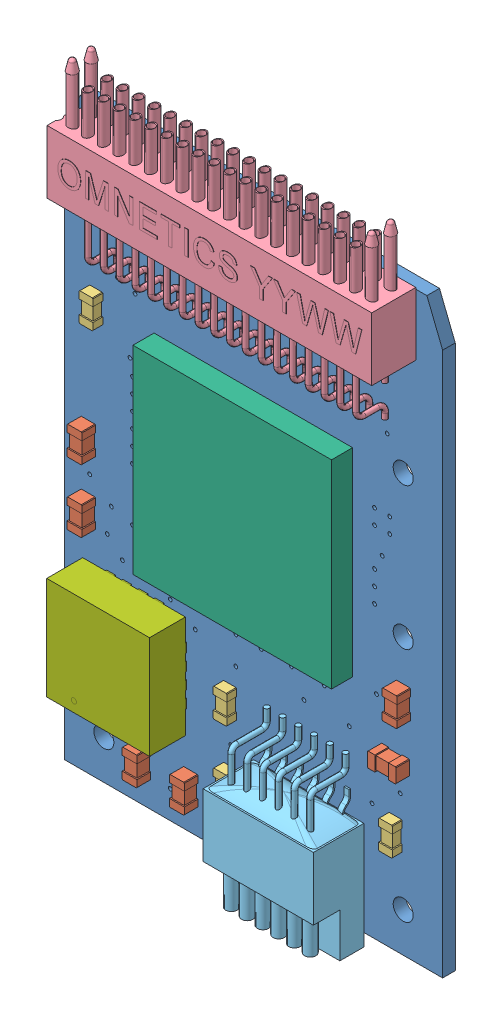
SolidWorks assembly RHD2132_accel_headstage.SLDASM, configuration Default (file format 15000). Lengths in mm.
Overall size (15.24 26.43 2.55).
15 component instances, 7 part files, 30 mates.
Components (placement in the parent):
- RHD2216_RHD2132_accel_headstage_PCB-1: RHD2216_RHD2132_accel_headstage_PCB.SLDPRT [Default] at origin size (15.24 23.49 0.51)
- 0402c_2320560-1: 0402c_2320560.sldprt [Default] at (13.6525 8.89 0.508) x (0 -1 0) z (0 0 1) size (1.15 0.6 0.55)
- 0402c_2320560-2: 0402c_2320560.sldprt [Default] at (3.175 1.5875 0.508) x (0 -1 0) z (0 0 1) size (1.15 0.6 0.55)
- 0402c_2320560-3: 0402c_2320560.sldprt [Default] at (13.335 6.6675 0.508) size (1.15 0.6 0.55)
- 0402c_2320560-4: 0402c_2320560.sldprt [Default] at (0.9525 11.7475 0.508) x (0 1 0) z (0 0 1) size (1.15 0.6 0.55)
- 0402c_2320560-5: 0402c_2320560.sldprt [Default] at (0.9525 9.2075 0.508) x (0 1 0) z (0 0 1) size (1.15 0.6 0.55)
- 0402c_2320560-6: 0402c_2320560.sldprt [Default] at (5.08 1.5875 0.508) x (0 1 0) z (0 0 1) size (1.15 0.6 0.55)
- 0402r_1430758-1: 0402r_1430758.sldprt [Default] at (1.27 16.4975 0.508) x (0 -1 0) z (0 0 1) size (1.15 0.55 0.4)
- 0402r_1430758-2: 0402r_1430758.sldprt [Default] at (6.6675 5.3975 0.508) x (0 1 0) z (0 0 1) size (1.15 0.55 0.4)
- 0402r_1430758-3: 0402r_1430758.sldprt [Default] at (6.6675 2.54 0.508) x (0 1 0) z (0 0 1) size (1.15 0.55 0.4)
- 0402r_1430758-4: 0402r_1430758.sldprt [Default] at (13.335 4.1275 0.508) x (0 1 0) z (0 0 1) size (1.15 0.55 0.4)
- A79025-001-1: A79025-001.SLDPRT [Default] at (6.35 22.2885 2.286) size (13.15 7.44 2.12)
- A79623-001-1: A79623-001.SLDPRT [Default] at (9.8425 3.81 0.508) x (1 0 0) z (0 -1 0) size (4.45 2.05 6.53)
- QFN_8x8mm-1: QFN_8x8mm.SLDPRT [Default] at (3.6119 8.6919 0.508) x (1 0 0) z (0 -1 0) size (8 0.85 8)
- ADXL335-1: ADXL335.SLDPRT [Default] at (2.8575 5.3975 0.508) x (0 1 0) z (0 0 1) size (4.14 4.14 1.5)
Mates (geometry in assembly coordinates):
- Coincident1: coincident anti-aligned: plane of rhd2132_headstage_accel-1 through (0 0 0.508) normal (0 0 1); plane of A79025-001-1 through (14.1605 21.0185 0.508) normal (0 0 -1)
- Parallel1: parallel aligned: plane of rhd2132_headstage_accel-1 through (0.635 23.495 0.508) normal (0 1 0); plane of A79025-001-1 through (14.1605 23.5585 2.286) normal (0 1 0)
- Distance1: distance = 0.0635 mm: line of A79025-001-1 through (1.0795 23.5585 0.508) axis (1 0 0); line of rhd2132_headstage_accel-1 through (14.605 23.495 0.508) axis (-1 0 0)
- Distance2: distance = 1.0795 mm: line of rhd2132_headstage_accel-1 through (0 21.9075 0.508) axis (0 -1 0); line of A79025-001-1 through (1.0795 21.0446 0.508) axis (0 1 0)
- Coincident4: coincident anti-aligned: plane of rhd2132_headstage_accel-1 through (0 0 0.508) normal (0 0 1); plane of QFN_8x8mm-1 through (3.6119 8.6919 0.508) normal (0 0 -1)
- Parallel2: parallel aligned: plane of rhd2132_headstage_accel-1 through (15.24 21.9075 0.508) normal (1 0 0); plane of QFN_8x8mm-1 through (11.6119 8.6919 1.358) normal (1 0 0)
- Coincident6: coincident anti-aligned: plane of rhd2132_headstage_accel-1 through (0 0 0.508) normal (0 0 1); plane of ADXL335-1 through (1.5875 4.1275 0.508) normal (0 0 -1)
- Parallel3: parallel aligned: plane of rhd2132_headstage_accel-1 through (0 0 0.508) normal (-1 0 0); plane of ADXL335-1 through (0.7875 7.4675 0.559) normal (-1 0 0)
- Coincident7: coincident anti-aligned: plane of rhd2132_headstage_accel-1 through (0 0 0.508) normal (0 0 1); plane of A79623-001-1 through (9.8425 3.81 0.508) normal (0 0 -1)
- Parallel4: parallel aligned: plane of rhd2132_headstage_accel-1 through (15.24 0 0.508) normal (0 -1 0); plane of A79623-001-1 through (12.065 -0.508 0.508) normal (0 -1 0)
- Coincident8: coincident anti-aligned: plane of rhd2132_headstage_accel-1 through (0 0 0.508) normal (0 0 1); plane of 0402r_1430758-1 through (2.095 16.4975 0.508) normal (0 0 -1)
- Parallel5: parallel aligned: plane of rhd2132_headstage_accel-1 through (15.24 0 0.508) normal (0 -1 0); plane of 0402r_1430758-1 through (1.02 15.9225 0.908) normal (0 -1 0)
- Coincident9: coincident anti-aligned: plane of rhd2132_headstage_accel-1 through (0 0 0.508) normal (0 0 1); plane of 0402c_2320560-4 through (0.1025 11.7475 0.508) normal (0 0 -1)
- Parallel6: parallel aligned: plane of rhd2132_headstage_accel-1 through (15.24 0 0.508) normal (0 -1 0); plane of 0402c_2320560-4 through (0.6775 11.1725 1.058) normal (0 -1 0)
- Coincident10: coincident anti-aligned: plane of rhd2132_headstage_accel-1 through (0 0 0.508) normal (0 0 1); plane of 0402c_2320560-5 through (0.1025 9.2075 0.508) normal (0 0 -1)
- Parallel7: parallel aligned: plane of rhd2132_headstage_accel-1 through (15.24 0 0.508) normal (0 -1 0); plane of 0402c_2320560-5 through (0.6775 8.6325 1.058) normal (0 -1 0)
- Coincident11: coincident anti-aligned: plane of rhd2132_headstage_accel-1 through (0 0 0.508) normal (0 0 1); plane of 0402c_2320560-2 through (4.025 1.5875 0.508) normal (0 0 -1)
- Parallel8: parallel aligned: plane of rhd2132_headstage_accel-1 through (15.24 0 0.508) normal (0 -1 0); plane of 0402c_2320560-2 through (2.9 1.0125 1.058) normal (0 -1 0)
- Coincident12: coincident anti-aligned: plane of rhd2132_headstage_accel-1 through (0 0 0.508) normal (0 0 1); plane of 0402c_2320560-6 through (4.23 1.5875 0.508) normal (0 0 -1)
- Parallel9: parallel aligned: plane of rhd2132_headstage_accel-1 through (15.24 0 0.508) normal (0 -1 0); plane of 0402c_2320560-6 through (4.805 1.0125 1.058) normal (0 -1 0)
- Coincident13: coincident anti-aligned: plane of rhd2132_headstage_accel-1 through (0 0 0.508) normal (0 0 1); plane of 0402r_1430758-3 through (5.8425 2.54 0.508) normal (0 0 -1)
- Parallel10: parallel aligned: plane of rhd2132_headstage_accel-1 through (15.24 0 0.508) normal (0 -1 0); plane of 0402r_1430758-3 through (6.4175 1.965 0.908) normal (0 -1 0)
- Coincident14: coincident anti-aligned: plane of rhd2132_headstage_accel-1 through (0 0 0.508) normal (0 0 1); plane of 0402r_1430758-2 through (5.8425 5.3975 0.508) normal (0 0 -1)
- Parallel11: parallel aligned: plane of rhd2132_headstage_accel-1 through (15.24 0 0.508) normal (0 -1 0); plane of 0402r_1430758-2 through (6.4175 4.8225 0.908) normal (0 -1 0)
- Coincident15: coincident anti-aligned: plane of rhd2132_headstage_accel-1 through (0 0 0.508) normal (0 0 1); plane of 0402r_1430758-4 through (12.51 4.1275 0.508) normal (0 0 -1)
- Parallel12: parallel aligned: plane of rhd2132_headstage_accel-1 through (15.24 0 0.508) normal (0 -1 0); plane of 0402r_1430758-4 through (13.085 3.5525 0.908) normal (0 -1 0)
- Coincident16: coincident anti-aligned: plane of rhd2132_headstage_accel-1 through (0 0 0.508) normal (0 0 1); plane of 0402c_2320560-3 through (13.335 7.5175 0.508) normal (0 0 -1)
- Parallel13: parallel aligned: plane of rhd2132_headstage_accel-1 through (15.24 21.9075 0.508) normal (1 0 0); plane of 0402c_2320560-3 through (13.91 6.3925 1.058) normal (1 0 0)
- Coincident17: coincident anti-aligned: plane of rhd2132_headstage_accel-1 through (0 0 0.508) normal (0 0 1); plane of 0402c_2320560-1 through (14.5025 8.89 0.508) normal (0 0 -1)
- Parallel14: parallel aligned: plane of rhd2132_headstage_accel-1 through (15.24 0 0.508) normal (0 -1 0); plane of 0402c_2320560-1 through (13.3775 8.315 1.058) normal (0 -1 0)
